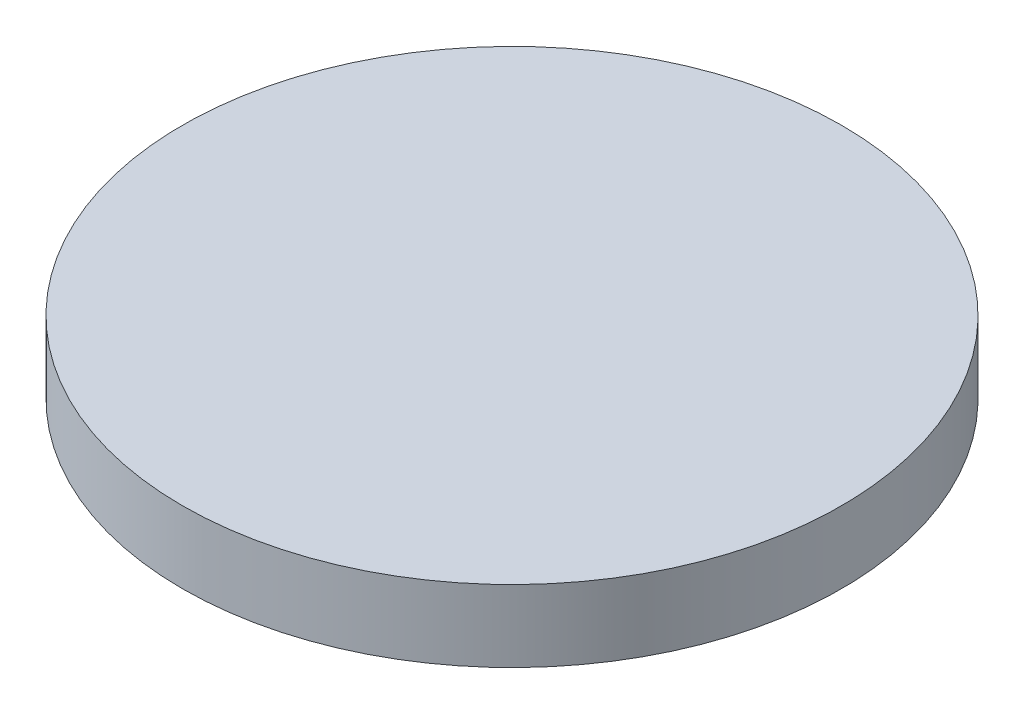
from build123d import *

# Parameters (mm, degrees)
SKETCH1_R           = 13.97
BOSS_EXTRUDE1_DEPTH = 3.048
SKETCH2_R           = 8.001
BOSS_EXTRUDE2_DEPTH = 1.778
SKETCH3_R           = 1.5875
CUT_EXTRUDE1_DEPTH  = 0.508
CIRPATTERN1_COUNT   = 12


with BuildPart() as part:
    # Sketch1 → Boss-Extrude1 (new body)
    with BuildSketch(Plane(origin=(0, 0, 0), x_dir=(1, 0, 0), z_dir=(0, 1, 0))):
        with Locations(Location((0, 0, 0), (0, 0, 90))):
            Circle(SKETCH1_R)
    extrude(amount=BOSS_EXTRUDE1_DEPTH)

    # Sketch2 → Boss-Extrude2 (add)
    with BuildSketch(Plane.XZ):
        with Locations(Location((0, 0, 0), (0, 0, 90))):
            Circle(SKETCH2_R)
    extrude(amount=BOSS_EXTRUDE2_DEPTH)

    # Sketch3 → Cut-Extrude1 (cut)
    with BuildSketch(Plane.XZ):
        with Locations(Location((0, 10.922, 0), (0, 0, 270))):
            Circle(SKETCH3_R)
    cut_extrude1 = extrude(amount=-CUT_EXTRUDE1_DEPTH, mode=Mode.SUBTRACT)

    # CirPattern1: Cut-Extrude1 ×12 about axis
    cirpattern1_axis = Axis((0, 0, 0), (0, 1, 0))
    for i in range(1, CIRPATTERN1_COUNT):
        add(cut_extrude1.rotate(cirpattern1_axis, i * 360 / CIRPATTERN1_COUNT), mode=Mode.SUBTRACT)


solid = part.part
